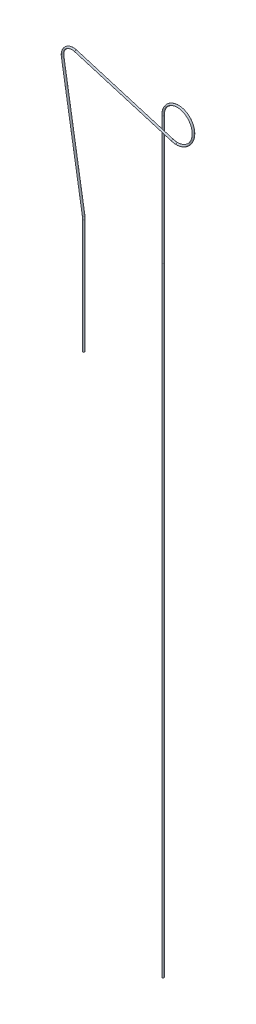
ISO-10303-21;
HEADER;
FILE_DESCRIPTION(('STEP AP214'),'2;1');
FILE_NAME('part.step','',(''),(''),'','','');
FILE_SCHEMA(('AUTOMOTIVE_DESIGN { 1 0 10303 214 1 1 1 1 }'));
ENDSEC;
DATA;
#1=APPLICATION_CONTEXT('core data for automotive mechanical design processes');
#2=APPLICATION_PROTOCOL_DEFINITION('international standard','automotive_design',2000,#1);
#3=PRODUCT_CONTEXT('',#1,'mechanical');
#4=PRODUCT('Part','Part','',(#3));
#5=PRODUCT_RELATED_PRODUCT_CATEGORY('part','',(#4));
#6=PRODUCT_DEFINITION_FORMATION('','',#4);
#7=PRODUCT_DEFINITION_CONTEXT('part definition',#1,'design');
#8=PRODUCT_DEFINITION('design','',#6,#7);
#9=PRODUCT_DEFINITION_SHAPE('','',#8);
#10=(LENGTH_UNIT() NAMED_UNIT(*) SI_UNIT(.MILLI.,.METRE.));
#11=(NAMED_UNIT(*) PLANE_ANGLE_UNIT() SI_UNIT($,.RADIAN.));
#12=(NAMED_UNIT(*) SI_UNIT($,.STERADIAN.) SOLID_ANGLE_UNIT());
#13=UNCERTAINTY_MEASURE_WITH_UNIT(LENGTH_MEASURE(1.E-05),#10,'distance_accuracy_value','');
#14=(GEOMETRIC_REPRESENTATION_CONTEXT(3) GLOBAL_UNCERTAINTY_ASSIGNED_CONTEXT((#13)) GLOBAL_UNIT_ASSIGNED_CONTEXT((#10,
#11,#12)) REPRESENTATION_CONTEXT('',''));
#15=CARTESIAN_POINT('',(0.,0.,0.));
#16=DIRECTION('',(0.,0.,1.));
#17=DIRECTION('',(1.,0.,0.));
#18=AXIS2_PLACEMENT_3D('',#15,#16,#17);
#19=CARTESIAN_POINT('',(88.1180848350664,50.8750000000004,0.));
#20=DIRECTION('',(0.,0.,1.));
#21=DIRECTION('',(1.,0.,0.));
#22=AXIS2_PLACEMENT_3D('',#19,#20,#21);
#23=TOROIDAL_SURFACE('',#22,25.5,1.49499999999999);
#24=CARTESIAN_POINT('',(80.8032427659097,26.4466745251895,0.));
#25=DIRECTION('',(0.9579735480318,-0.286856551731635,0.));
#26=DIRECTION('',(0.,0.,1.));
#27=AXIS2_PLACEMENT_3D('',#24,#25,#26);
#28=CIRCLE('',#27,1.49499999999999);
#29=CARTESIAN_POINT('',(80.3743922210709,25.014504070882,0.));
#30=VERTEX_POINT('',#29);
#31=EDGE_CURVE('E34',#30,#30,#28,.T.);
#32=CARTESIAN_POINT('',(88.1180848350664,25.3750000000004,0.));
#33=DIRECTION('',(1.,0.,0.));
#34=DIRECTION('',(0.,0.,1.));
#35=AXIS2_PLACEMENT_3D('',#32,#33,#34);
#36=CIRCLE('',#35,1.49499999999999);
#37=CARTESIAN_POINT('',(88.1180848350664,23.8800000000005,0.));
#38=VERTEX_POINT('',#37);
#39=EDGE_CURVE('E10',#38,#38,#36,.T.);
#40=CARTESIAN_POINT('',(88.1180848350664,50.8750000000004,0.));
#41=DIRECTION('',(0.,0.,1.));
#42=DIRECTION('',(1.,0.,0.));
#43=AXIS2_PLACEMENT_3D('',#40,#41,#42);
#44=CIRCLE('',#43,26.995);
#45=EDGE_CURVE('',#30,#38,#44,.T.);
#46=ORIENTED_EDGE('',*,*,#31,.T.);
#47=ORIENTED_EDGE('',*,*,#39,.F.);
#48=ORIENTED_EDGE('',*,*,#45,.T.);
#49=ORIENTED_EDGE('',*,*,#45,.F.);
#50=EDGE_LOOP('',(#46,#48,#47,#49));
#51=FACE_BOUND('',#50,.T.);
#52=ADVANCED_FACE('F28',(#51),#23,.T.);
#53=CARTESIAN_POINT('',(-75.8271337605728,73.3482302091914,0.));
#54=DIRECTION('',(0.9579735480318,-0.286856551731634,0.));
#55=DIRECTION('',(0.286856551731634,0.9579735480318,0.));
#56=AXIS2_PLACEMENT_3D('',#53,#54,#55);
#57=CYLINDRICAL_SURFACE('',#56,1.49499999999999);
#58=CARTESIAN_POINT('',(-75.8271337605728,73.3482302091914,0.));
#59=DIRECTION('',(0.9579735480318,-0.286856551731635,0.));
#60=DIRECTION('',(0.,0.,1.));
#61=AXIS2_PLACEMENT_3D('',#58,#59,#60);
#62=CIRCLE('',#61,1.49499999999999);
#63=CARTESIAN_POINT('',(-75.398283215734,74.7804006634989,0.));
#64=VERTEX_POINT('',#63);
#65=EDGE_CURVE('E38',#64,#64,#62,.T.);
#66=ORIENTED_EDGE('',*,*,#65,.T.);
#67=EDGE_LOOP('',(#66));
#68=FACE_BOUND('',#67,.T.);
#69=ORIENTED_EDGE('',*,*,#31,.F.);
#70=EDGE_LOOP('',(#69));
#71=FACE_BOUND('',#70,.T.);
#72=ADVANCED_FACE('F105',(#68,#71),#57,.T.);
#73=CARTESIAN_POINT('',(-80.5602668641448,57.5416666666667,0.));
#74=DIRECTION('',(0.,0.,-1.));
#75=DIRECTION('',(-1.,0.,0.));
#76=AXIS2_PLACEMENT_3D('',#73,#74,#75);
#77=TOROIDAL_SURFACE('',#76,16.5,1.49499999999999);
#78=CARTESIAN_POINT('',(-96.8409069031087,54.8601074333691,0.));
#79=DIRECTION('',(-0.162518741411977,0.986705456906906,0.));
#80=DIRECTION('',(0.,0.,1.));
#81=AXIS2_PLACEMENT_3D('',#78,#79,#80);
#82=CIRCLE('',#81,1.49499999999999);
#83=CARTESIAN_POINT('',(-98.3160315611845,54.6171419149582,0.));
#84=VERTEX_POINT('',#83);
#85=EDGE_CURVE('E42',#84,#84,#82,.T.);
#86=CARTESIAN_POINT('',(-80.5602668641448,57.5416666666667,0.));
#87=DIRECTION('',(0.,0.,-1.));
#88=DIRECTION('',(-1.,0.,0.));
#89=AXIS2_PLACEMENT_3D('',#86,#87,#88);
#90=CIRCLE('',#89,17.995);
#91=EDGE_CURVE('',#84,#64,#90,.T.);
#92=ORIENTED_EDGE('',*,*,#85,.T.);
#93=ORIENTED_EDGE('',*,*,#65,.F.);
#94=ORIENTED_EDGE('',*,*,#91,.T.);
#95=ORIENTED_EDGE('',*,*,#91,.F.);
#96=EDGE_LOOP('',(#92,#94,#93,#95));
#97=FACE_BOUND('',#96,.T.);
#98=ADVANCED_FACE('F102',(#97),#77,.T.);
#99=CARTESIAN_POINT('',(-62.8655999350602,-151.415307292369,0.));
#100=DIRECTION('',(-0.162518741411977,0.986705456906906,0.));
#101=DIRECTION('',(-0.986705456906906,-0.162518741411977,0.));
#102=AXIS2_PLACEMENT_3D('',#99,#100,#101);
#103=CYLINDRICAL_SURFACE('',#102,1.49499999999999);
#104=CARTESIAN_POINT('',(-62.8655999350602,-151.415307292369,0.));
#105=DIRECTION('',(-0.162518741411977,0.986705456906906,0.));
#106=DIRECTION('',(0.,0.,1.));
#107=AXIS2_PLACEMENT_3D('',#104,#105,#106);
#108=CIRCLE('',#107,1.49499999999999);
#109=CARTESIAN_POINT('',(-61.3904752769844,-151.172341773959,0.));
#110=VERTEX_POINT('',#109);
#111=EDGE_CURVE('E47',#110,#110,#108,.T.);
#112=ORIENTED_EDGE('',*,*,#111,.T.);
#113=EDGE_LOOP('',(#112));
#114=FACE_BOUND('',#113,.T.);
#115=ORIENTED_EDGE('',*,*,#85,.F.);
#116=EDGE_LOOP('',(#115));
#117=FACE_BOUND('',#116,.T.);
#118=ADVANCED_FACE('F98',(#114,#117),#103,.T.);
#119=CARTESIAN_POINT('',(-90.0000000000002,-155.884572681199,0.));
#120=DIRECTION('',(0.,0.,1.));
#121=DIRECTION('',(1.,0.,0.));
#122=AXIS2_PLACEMENT_3D('',#119,#120,#121);
#123=TOROIDAL_SURFACE('',#122,27.5,1.49499999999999);
#124=CARTESIAN_POINT('',(-62.5000000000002,-155.884572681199,0.));
#125=DIRECTION('',(0.,1.,0.));
#126=DIRECTION('',(0.,0.,1.));
#127=AXIS2_PLACEMENT_3D('',#124,#125,#126);
#128=CIRCLE('',#127,1.49499999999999);
#129=CARTESIAN_POINT('',(-61.0050000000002,-155.884572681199,0.));
#130=VERTEX_POINT('',#129);
#131=EDGE_CURVE('E50',#130,#130,#128,.T.);
#132=CARTESIAN_POINT('',(-90.0000000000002,-155.884572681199,0.));
#133=DIRECTION('',(0.,0.,1.));
#134=DIRECTION('',(1.,0.,0.));
#135=AXIS2_PLACEMENT_3D('',#132,#133,#134);
#136=CIRCLE('',#135,28.995);
#137=EDGE_CURVE('',#130,#110,#136,.T.);
#138=ORIENTED_EDGE('',*,*,#131,.T.);
#139=ORIENTED_EDGE('',*,*,#111,.F.);
#140=ORIENTED_EDGE('',*,*,#137,.T.);
#141=ORIENTED_EDGE('',*,*,#137,.F.);
#142=EDGE_LOOP('',(#138,#140,#139,#141));
#143=FACE_BOUND('',#142,.T.);
#144=ADVANCED_FACE('F94',(#143),#123,.T.);
#145=CARTESIAN_POINT('',(-62.5000000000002,-155.884572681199,0.));
#146=DIRECTION('',(0.,-1.,0.));
#147=DIRECTION('',(1.,0.,0.));
#148=AXIS2_PLACEMENT_3D('',#145,#146,#147);
#149=CYLINDRICAL_SURFACE('',#148,1.49499999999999);
#150=ORIENTED_EDGE('',*,*,#131,.F.);
#151=EDGE_LOOP('',(#150));
#152=FACE_BOUND('',#151,.T.);
#153=CARTESIAN_POINT('',(-62.5000000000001,-340.884572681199,0.));
#154=DIRECTION('',(0.,1.,0.));
#155=DIRECTION('',(0.,0.,1.));
#156=AXIS2_PLACEMENT_3D('',#153,#154,#155);
#157=CIRCLE('',#156,1.49499999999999);
#158=CARTESIAN_POINT('',(-62.5000000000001,-340.884572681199,1.49499999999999));
#159=VERTEX_POINT('',#158);
#160=EDGE_CURVE('E51',#159,#159,#157,.T.);
#161=ORIENTED_EDGE('',*,*,#160,.T.);
#162=EDGE_LOOP('',(#161));
#163=FACE_BOUND('',#162,.T.);
#164=ADVANCED_FACE('F90',(#152,#163),#149,.T.);
#165=CARTESIAN_POINT('',(-62.5000000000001,-340.884572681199,0.));
#166=DIRECTION('',(0.,1.,0.));
#167=DIRECTION('',(0.,0.,1.));
#168=AXIS2_PLACEMENT_3D('',#165,#166,#167);
#169=PLANE('',#168);
#170=ORIENTED_EDGE('',*,*,#160,.F.);
#171=EDGE_LOOP('',(#170));
#172=FACE_BOUND('',#171,.T.);
#173=ADVANCED_FACE('F81',(#172),#169,.F.);
#174=CARTESIAN_POINT('',(88.1180848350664,26.8700000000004,0.));
#175=CARTESIAN_POINT('',(94.5502051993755,26.8700000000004,-0.166666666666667));
#176=CARTESIAN_POINT('',(100.120584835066,30.086060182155,-0.333333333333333));
#177=CARTESIAN_POINT('',(105.690964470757,33.3021203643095,-0.5));
#178=CARTESIAN_POINT('',(108.907024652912,38.8725000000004,-0.666666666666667));
#179=CARTESIAN_POINT('',(112.123084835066,44.4428796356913,-0.833333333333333));
#180=CARTESIAN_POINT('',(112.123084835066,50.8750000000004,-1.));
#181=CARTESIAN_POINT('',(112.123084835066,57.3071203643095,-1.16666666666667));
#182=CARTESIAN_POINT('',(108.907024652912,62.8775000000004,-1.33333333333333));
#183=CARTESIAN_POINT('',(105.690964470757,68.4478796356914,-1.5));
#184=CARTESIAN_POINT('',(100.120584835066,71.6639398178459,-1.66666666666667));
#185=CARTESIAN_POINT('',(94.5502051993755,74.8800000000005,-1.83333333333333));
#186=CARTESIAN_POINT('',(88.1180848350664,74.8800000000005,-2.));
#187=CARTESIAN_POINT('',(81.6859644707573,74.8800000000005,-2.16666666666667));
#188=CARTESIAN_POINT('',(76.1155848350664,71.6639398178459,-2.33333333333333));
#189=CARTESIAN_POINT('',(70.5452051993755,68.4478796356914,-2.5));
#190=CARTESIAN_POINT('',(67.3291450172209,62.8775000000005,-2.66666666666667));
#191=CARTESIAN_POINT('',(64.1130848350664,57.3071203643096,-2.83333333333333));
#192=CARTESIAN_POINT('',(64.1130848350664,50.8750000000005,-3.));
#193=CARTESIAN_POINT('',(88.1180848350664,26.8700000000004,2.98999999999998));
#194=CARTESIAN_POINT('',(94.5502051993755,26.8700000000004,2.82333333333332));
#195=CARTESIAN_POINT('',(100.120584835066,30.086060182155,2.65666666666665));
#196=CARTESIAN_POINT('',(105.690964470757,33.3021203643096,2.48999999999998));
#197=CARTESIAN_POINT('',(108.907024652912,38.8725000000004,2.32333333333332));
#198=CARTESIAN_POINT('',(112.123084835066,44.4428796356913,2.15666666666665));
#199=CARTESIAN_POINT('',(112.123084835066,50.8750000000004,1.98999999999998));
#200=CARTESIAN_POINT('',(112.123084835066,57.3071203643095,1.82333333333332));
#201=CARTESIAN_POINT('',(108.907024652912,62.8775000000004,1.65666666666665));
#202=CARTESIAN_POINT('',(105.690964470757,68.4478796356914,1.48999999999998));
#203=CARTESIAN_POINT('',(100.120584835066,71.6639398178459,1.32333333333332));
#204=CARTESIAN_POINT('',(94.5502051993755,74.8800000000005,1.15666666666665));
#205=CARTESIAN_POINT('',(88.1180848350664,74.8800000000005,0.989999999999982));
#206=CARTESIAN_POINT('',(81.6859644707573,74.8800000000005,0.823333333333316));
#207=CARTESIAN_POINT('',(76.1155848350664,71.6639398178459,0.656666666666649));
#208=CARTESIAN_POINT('',(70.5452051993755,68.4478796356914,0.489999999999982));
#209=CARTESIAN_POINT('',(67.3291450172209,62.8775000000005,0.323333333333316));
#210=CARTESIAN_POINT('',(64.1130848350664,57.3071203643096,0.156666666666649));
#211=CARTESIAN_POINT('',(64.1130848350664,50.8750000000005,-0.0100000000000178));
#212=CARTESIAN_POINT('',(88.1180848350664,23.8800000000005,2.98999999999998));
#213=CARTESIAN_POINT('',(95.3513732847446,23.8800000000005,2.82333333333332));
#214=CARTESIAN_POINT('',(101.615584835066,27.4966442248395,2.65666666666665));
#215=CARTESIAN_POINT('',(107.879796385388,31.1132884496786,2.48999999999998));
#216=CARTESIAN_POINT('',(111.496440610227,37.3775000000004,2.32333333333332));
#217=CARTESIAN_POINT('',(115.113084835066,43.6417115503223,2.15666666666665));
#218=CARTESIAN_POINT('',(115.113084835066,50.8750000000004,1.98999999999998));
#219=CARTESIAN_POINT('',(115.113084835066,58.1082884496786,1.82333333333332));
#220=CARTESIAN_POINT('',(111.496440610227,64.3725000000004,1.65666666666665));
#221=CARTESIAN_POINT('',(107.879796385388,70.6367115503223,1.48999999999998));
#222=CARTESIAN_POINT('',(101.615584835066,74.2533557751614,1.32333333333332));
#223=CARTESIAN_POINT('',(95.3513732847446,77.8700000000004,1.15666666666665));
#224=CARTESIAN_POINT('',(88.1180848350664,77.8700000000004,0.989999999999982));
#225=CARTESIAN_POINT('',(80.8847963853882,77.8700000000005,0.823333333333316));
#226=CARTESIAN_POINT('',(74.6205848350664,74.2533557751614,0.656666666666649));
#227=CARTESIAN_POINT('',(68.3563732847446,70.6367115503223,0.489999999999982));
#228=CARTESIAN_POINT('',(64.7397290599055,64.3725000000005,0.323333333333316));
#229=CARTESIAN_POINT('',(61.1230848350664,58.1082884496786,0.156666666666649));
#230=CARTESIAN_POINT('',(61.1230848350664,50.8750000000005,-0.0100000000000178));
#231=CARTESIAN_POINT('',(88.1180848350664,23.8800000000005,0.));
#232=CARTESIAN_POINT('',(95.3513732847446,23.8800000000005,-0.166666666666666));
#233=CARTESIAN_POINT('',(101.615584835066,27.4966442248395,-0.333333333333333));
#234=CARTESIAN_POINT('',(107.879796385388,31.1132884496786,-0.5));
#235=CARTESIAN_POINT('',(111.496440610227,37.3775000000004,-0.666666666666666));
#236=CARTESIAN_POINT('',(115.113084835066,43.6417115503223,-0.833333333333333));
#237=CARTESIAN_POINT('',(115.113084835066,50.8750000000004,-1.));
#238=CARTESIAN_POINT('',(115.113084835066,58.1082884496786,-1.16666666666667));
#239=CARTESIAN_POINT('',(111.496440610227,64.3725000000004,-1.33333333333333));
#240=CARTESIAN_POINT('',(107.879796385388,70.6367115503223,-1.5));
#241=CARTESIAN_POINT('',(101.615584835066,74.2533557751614,-1.66666666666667));
#242=CARTESIAN_POINT('',(95.3513732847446,77.8700000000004,-1.83333333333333));
#243=CARTESIAN_POINT('',(88.1180848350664,77.8700000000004,-2.));
#244=CARTESIAN_POINT('',(80.8847963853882,77.8700000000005,-2.16666666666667));
#245=CARTESIAN_POINT('',(74.6205848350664,74.2533557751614,-2.33333333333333));
#246=CARTESIAN_POINT('',(68.3563732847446,70.6367115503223,-2.5));
#247=CARTESIAN_POINT('',(64.7397290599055,64.3725000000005,-2.66666666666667));
#248=CARTESIAN_POINT('',(61.1230848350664,58.1082884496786,-2.83333333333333));
#249=CARTESIAN_POINT('',(61.1230848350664,50.8750000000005,-3.));
#250=CARTESIAN_POINT('',(88.1180848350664,23.8800000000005,-2.98999999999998));
#251=CARTESIAN_POINT('',(95.3513732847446,23.8800000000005,-3.15666666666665));
#252=CARTESIAN_POINT('',(101.615584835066,27.4966442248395,-3.32333333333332));
#253=CARTESIAN_POINT('',(107.879796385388,31.1132884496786,-3.48999999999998));
#254=CARTESIAN_POINT('',(111.496440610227,37.3775000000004,-3.65666666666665));
#255=CARTESIAN_POINT('',(115.113084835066,43.6417115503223,-3.82333333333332));
#256=CARTESIAN_POINT('',(115.113084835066,50.8750000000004,-3.98999999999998));
#257=CARTESIAN_POINT('',(115.113084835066,58.1082884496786,-4.15666666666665));
#258=CARTESIAN_POINT('',(111.496440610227,64.3725000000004,-4.32333333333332));
#259=CARTESIAN_POINT('',(107.879796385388,70.6367115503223,-4.48999999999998));
#260=CARTESIAN_POINT('',(101.615584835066,74.2533557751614,-4.65666666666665));
#261=CARTESIAN_POINT('',(95.3513732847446,77.8700000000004,-4.82333333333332));
#262=CARTESIAN_POINT('',(88.1180848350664,77.8700000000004,-4.98999999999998));
#263=CARTESIAN_POINT('',(80.8847963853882,77.8700000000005,-5.15666666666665));
#264=CARTESIAN_POINT('',(74.6205848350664,74.2533557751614,-5.32333333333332));
#265=CARTESIAN_POINT('',(68.3563732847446,70.6367115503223,-5.48999999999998));
#266=CARTESIAN_POINT('',(64.7397290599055,64.3725000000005,-5.65666666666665));
#267=CARTESIAN_POINT('',(61.1230848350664,58.1082884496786,-5.82333333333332));
#268=CARTESIAN_POINT('',(61.1230848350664,50.8750000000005,-5.98999999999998));
#269=CARTESIAN_POINT('',(88.1180848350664,26.8700000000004,-2.98999999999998));
#270=CARTESIAN_POINT('',(94.5502051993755,26.8700000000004,-3.15666666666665));
#271=CARTESIAN_POINT('',(100.120584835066,30.086060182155,-3.32333333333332));
#272=CARTESIAN_POINT('',(105.690964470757,33.3021203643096,-3.48999999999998));
#273=CARTESIAN_POINT('',(108.907024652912,38.8725000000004,-3.65666666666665));
#274=CARTESIAN_POINT('',(112.123084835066,44.4428796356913,-3.82333333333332));
#275=CARTESIAN_POINT('',(112.123084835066,50.8750000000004,-3.98999999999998));
#276=CARTESIAN_POINT('',(112.123084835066,57.3071203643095,-4.15666666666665));
#277=CARTESIAN_POINT('',(108.907024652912,62.8775000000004,-4.32333333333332));
#278=CARTESIAN_POINT('',(105.690964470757,68.4478796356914,-4.48999999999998));
#279=CARTESIAN_POINT('',(100.120584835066,71.6639398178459,-4.65666666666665));
#280=CARTESIAN_POINT('',(94.5502051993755,74.8800000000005,-4.82333333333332));
#281=CARTESIAN_POINT('',(88.1180848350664,74.8800000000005,-4.98999999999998));
#282=CARTESIAN_POINT('',(81.6859644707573,74.8800000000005,-5.15666666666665));
#283=CARTESIAN_POINT('',(76.1155848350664,71.6639398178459,-5.32333333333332));
#284=CARTESIAN_POINT('',(70.5452051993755,68.4478796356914,-5.48999999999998));
#285=CARTESIAN_POINT('',(67.3291450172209,62.8775000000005,-5.65666666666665));
#286=CARTESIAN_POINT('',(64.1130848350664,57.3071203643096,-5.82333333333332));
#287=CARTESIAN_POINT('',(64.1130848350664,50.8750000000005,-5.98999999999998));
#288=CARTESIAN_POINT('',(88.1180848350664,26.8700000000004,0.));
#289=CARTESIAN_POINT('',(94.5502051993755,26.8700000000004,-0.166666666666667));
#290=CARTESIAN_POINT('',(100.120584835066,30.086060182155,-0.333333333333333));
#291=CARTESIAN_POINT('',(105.690964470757,33.3021203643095,-0.5));
#292=CARTESIAN_POINT('',(108.907024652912,38.8725000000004,-0.666666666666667));
#293=CARTESIAN_POINT('',(112.123084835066,44.4428796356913,-0.833333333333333));
#294=CARTESIAN_POINT('',(112.123084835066,50.8750000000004,-1.));
#295=CARTESIAN_POINT('',(112.123084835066,57.3071203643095,-1.16666666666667));
#296=CARTESIAN_POINT('',(108.907024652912,62.8775000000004,-1.33333333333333));
#297=CARTESIAN_POINT('',(105.690964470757,68.4478796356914,-1.5));
#298=CARTESIAN_POINT('',(100.120584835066,71.6639398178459,-1.66666666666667));
#299=CARTESIAN_POINT('',(94.5502051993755,74.8800000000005,-1.83333333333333));
#300=CARTESIAN_POINT('',(88.1180848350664,74.8800000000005,-2.));
#301=CARTESIAN_POINT('',(81.6859644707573,74.8800000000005,-2.16666666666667));
#302=CARTESIAN_POINT('',(76.1155848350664,71.6639398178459,-2.33333333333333));
#303=CARTESIAN_POINT('',(70.5452051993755,68.4478796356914,-2.5));
#304=CARTESIAN_POINT('',(67.3291450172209,62.8775000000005,-2.66666666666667));
#305=CARTESIAN_POINT('',(64.1130848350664,57.3071203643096,-2.83333333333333));
#306=CARTESIAN_POINT('',(64.1130848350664,50.8750000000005,-3.));
#307=(BOUNDED_SURFACE() B_SPLINE_SURFACE(3,2,((#174,#175,#176,#177,#178,#179,#180,#181,#182,
#183,#184,#185,#186,#187,#188,#189,#190,#191,#192),(#193,#194,#195,#196,#197,#198,#199,#200,
#201,#202,#203,#204,#205,#206,#207,#208,#209,#210,#211),(#212,#213,#214,#215,#216,#217,#218,
#219,#220,#221,#222,#223,#224,#225,#226,#227,#228,#229,#230),(#231,#232,#233,#234,#235,#236,
#237,#238,#239,#240,#241,#242,#243,#244,#245,#246,#247,#248,#249),(#250,#251,#252,#253,#254,
#255,#256,#257,#258,#259,#260,#261,#262,#263,#264,#265,#266,#267,#268),(#269,#270,#271,#272,
#273,#274,#275,#276,#277,#278,#279,#280,#281,#282,#283,#284,#285,#286,#287),(#288,#289,#290,
#291,#292,#293,#294,#295,#296,#297,#298,#299,#300,#301,#302,#303,#304,#305,#306)),.UNSPECIFIED.,
.T.,.F.,.F.) B_SPLINE_SURFACE_WITH_KNOTS((4,3,4),(3,2,2,2,2,2,2,2,2,3),(0.,0.5,1.),(0.,
0.0833333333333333,0.166666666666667,0.25,0.333333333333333,0.416666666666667,0.5,
0.583333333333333,0.666666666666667,0.75),
.UNSPECIFIED.) GEOMETRIC_REPRESENTATION_ITEM() RATIONAL_B_SPLINE_SURFACE(((1.,0.965925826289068,
1.,0.965925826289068,1.,0.965925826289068,1.,0.965925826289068,1.,0.965925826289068,1.,
0.965925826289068,1.,0.965925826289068,1.,0.965925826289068,1.,0.965925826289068,1.),
(0.333333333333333,0.321975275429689,0.333333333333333,0.321975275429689,0.333333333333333,
0.321975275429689,0.333333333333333,0.321975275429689,0.333333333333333,0.321975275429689,
0.333333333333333,0.321975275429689,0.333333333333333,0.321975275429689,0.333333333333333,
0.321975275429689,0.333333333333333,0.321975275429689,0.333333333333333),(0.333333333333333,
0.321975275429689,0.333333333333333,0.321975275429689,0.333333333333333,0.321975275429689,
0.333333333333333,0.321975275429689,0.333333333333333,0.321975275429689,0.333333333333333,
0.321975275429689,0.333333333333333,0.321975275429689,0.333333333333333,0.321975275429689,
0.333333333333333,0.321975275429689,0.333333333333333),(1.,0.965925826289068,1.,
0.965925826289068,1.,0.965925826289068,1.,0.965925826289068,1.,0.965925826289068,1.,
0.965925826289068,1.,0.965925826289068,1.,0.965925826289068,1.,0.965925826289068,1.),
(0.333333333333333,0.321975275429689,0.333333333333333,0.321975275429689,0.333333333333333,
0.321975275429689,0.333333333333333,0.321975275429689,0.333333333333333,0.321975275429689,
0.333333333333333,0.321975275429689,0.333333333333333,0.321975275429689,0.333333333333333,
0.321975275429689,0.333333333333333,0.321975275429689,0.333333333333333),(0.333333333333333,
0.321975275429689,0.333333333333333,0.321975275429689,0.333333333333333,0.321975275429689,
0.333333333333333,0.321975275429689,0.333333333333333,0.321975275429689,0.333333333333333,
0.321975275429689,0.333333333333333,0.321975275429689,0.333333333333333,0.321975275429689,
0.333333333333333,0.321975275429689,0.333333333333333),(1.,0.965925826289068,1.,
0.965925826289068,1.,0.965925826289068,1.,0.965925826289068,1.,0.965925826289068,1.,
0.965925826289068,1.,0.965925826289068,1.,0.965925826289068,1.,0.965925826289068,1.))) REPRESENTATION_ITEM('') SURFACE());
#308=CARTESIAN_POINT('',(62.6180848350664,50.8750000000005,-3.));
#309=DIRECTION('',(0.,-1.,0.));
#310=DIRECTION('',(0.,0.,-1.));
#311=AXIS2_PLACEMENT_3D('',#308,#309,#310);
#312=CIRCLE('',#311,1.49499999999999);
#313=CARTESIAN_POINT('',(62.6180848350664,50.8750000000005,-4.49499999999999));
#314=VERTEX_POINT('',#313);
#315=EDGE_CURVE('E60',#314,#314,#312,.T.);
#316=ORIENTED_EDGE('',*,*,#39,.T.);
#317=EDGE_LOOP('',(#316));
#318=FACE_BOUND('',#317,.T.);
#319=ORIENTED_EDGE('',*,*,#315,.F.);
#320=EDGE_LOOP('',(#319));
#321=FACE_BOUND('',#320,.T.);
#322=ADVANCED_FACE('F75',(#318,#321),#307,.T.);
#323=CARTESIAN_POINT('',(62.50000864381,-155.868866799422,-3.));
#324=DIRECTION('',(-4.48499529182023E-09,-1.,0.));
#325=DIRECTION('',(1.,-4.48499529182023E-09,0.));
#326=AXIS2_PLACEMENT_3D('',#323,#324,#325);
#327=CYLINDRICAL_SURFACE('',#326,1.49499999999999);
#328=CARTESIAN_POINT('',(62.50000864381,-155.868866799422,-3.));
#329=DIRECTION('',(0.,-1.,0.));
#330=DIRECTION('',(0.,0.,-1.));
#331=AXIS2_PLACEMENT_3D('',#328,#329,#330);
#332=CIRCLE('',#331,1.49499999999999);
#333=CARTESIAN_POINT('',(62.50000864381,-155.868866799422,-4.49499999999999));
#334=VERTEX_POINT('',#333);
#335=EDGE_CURVE('E59',#334,#334,#332,.T.);
#336=ORIENTED_EDGE('',*,*,#335,.T.);
#337=EDGE_LOOP('',(#336));
#338=FACE_BOUND('',#337,.T.);
#339=CARTESIAN_POINT('',(62.5000041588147,-1155.86886679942,-3.));
#340=DIRECTION('',(0.,-1.,0.));
#341=DIRECTION('',(0.,0.,-1.));
#342=AXIS2_PLACEMENT_3D('',#339,#340,#341);
#343=CIRCLE('',#342,1.49499999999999);
#344=CARTESIAN_POINT('',(62.5000041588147,-1155.86886679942,-4.49499999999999));
#345=VERTEX_POINT('',#344);
#346=EDGE_CURVE('E54',#345,#345,#343,.T.);
#347=ORIENTED_EDGE('',*,*,#346,.F.);
#348=EDGE_LOOP('',(#347));
#349=FACE_BOUND('',#348,.T.);
#350=ADVANCED_FACE('F71',(#338,#349),#327,.T.);
#351=DIRECTION('',(0.000571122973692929,0.999999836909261,0.));
#352=VECTOR('',#351,1.);
#353=SURFACE_OF_LINEAR_EXTRUSION('',#332,#352);
#354=ORIENTED_EDGE('',*,*,#335,.F.);
#355=EDGE_LOOP('',(#354));
#356=FACE_BOUND('',#355,.T.);
#357=ORIENTED_EDGE('',*,*,#315,.T.);
#358=EDGE_LOOP('',(#357));
#359=FACE_BOUND('',#358,.T.);
#360=ADVANCED_FACE('F66',(#356,#359),#353,.F.);
#361=CARTESIAN_POINT('',(62.5000041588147,-1155.86886679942,-3.));
#362=DIRECTION('',(0.,-1.,0.));
#363=DIRECTION('',(0.,0.,-1.));
#364=AXIS2_PLACEMENT_3D('',#361,#362,#363);
#365=PLANE('',#364);
#366=ORIENTED_EDGE('',*,*,#346,.T.);
#367=EDGE_LOOP('',(#366));
#368=FACE_BOUND('',#367,.T.);
#369=ADVANCED_FACE('F70',(#368),#365,.T.);
#370=CLOSED_SHELL('',(#52,#72,#98,#118,#144,#164,#173,#322,#350,#360,#369));
#371=MANIFOLD_SOLID_BREP('B2',#370);
#372=ADVANCED_BREP_SHAPE_REPRESENTATION('',(#18,#371),#14);
#373=SHAPE_DEFINITION_REPRESENTATION(#9,#372);
ENDSEC;
END-ISO-10303-21;
